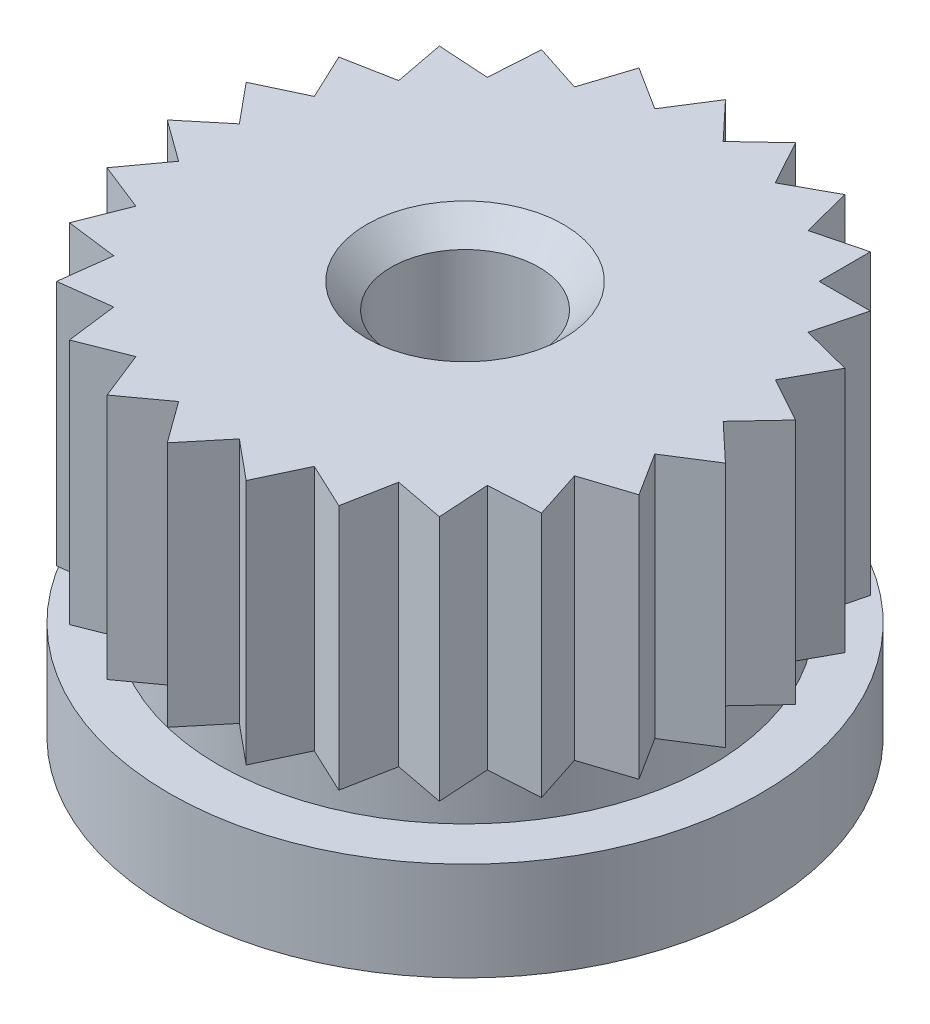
from build123d import *

# Parameters (mm, degrees)
SKETCH1_R                     = 3
BOSS_EXTRUDE1_DEPTH           = 4
SKETCH2_W                     = 0.65
SKETCH2_H                     = 0.65
CUT_EXTRUDE1_DEPTH            = 2.5
CIRPATTERN1_COUNT             = 25
SKETCH3_OUTSIDE_W             = 9.876
SKETCH3_OUTSIDE_H             = 9.876
SKETCH3_OUTSIDE_R             = 2.5
CUT_EXTRUDE2_DEPTH            = 0.5
CSK_FOR_M3_SFHCS1_D           = 1.5
CSK_FOR_M3_SFHCS1_CSINK_D     = 2
CSK_FOR_M3_SFHCS1_CSINK_ANGLE = 90


with BuildPart() as part:
    # Sketch1 → Boss-Extrude1 (new body)
    with BuildSketch(Plane(origin=(0, 0, 0), x_dir=(1, 0, 0), z_dir=(0, 1, 0))):
        with Locations(Location((0, 0, 0), (0, 0, 270))):
            Circle(SKETCH1_R)
    extrude(amount=BOSS_EXTRUDE1_DEPTH)

    # Sketch2 → Cut-Extrude1 (cut)
    with BuildSketch(Plane(origin=(0, 4, 0), x_dir=(1, 0, 0), z_dir=(0, 1, 0))):
        with Locations((2.121320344, 2.121320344)):
            Rectangle(SKETCH2_W, SKETCH2_H)
    cut_extrude1 = extrude(amount=-CUT_EXTRUDE1_DEPTH, mode=Mode.SUBTRACT)

    # CirPattern1: Cut-Extrude1 ×25 about axis
    cirpattern1_axis = Axis((0, 0, 0), (0, 1, 0))
    for i in range(1, CIRPATTERN1_COUNT):
        add(cut_extrude1.rotate(cirpattern1_axis, i * 360 / CIRPATTERN1_COUNT), mode=Mode.SUBTRACT)

    # Sketch3 outside → Cut-Extrude2 (cut)
    with BuildSketch(Plane(origin=(0, 1.5, 0), x_dir=(1, 0, 0), z_dir=(0, 1, 0))):
        Rectangle(SKETCH3_OUTSIDE_W, SKETCH3_OUTSIDE_H)
        with Locations(Location((0, 0, 0), (0, 0, 270))):
            Circle(SKETCH3_OUTSIDE_R, mode=Mode.SUBTRACT)
    extrude(amount=-CUT_EXTRUDE2_DEPTH, mode=Mode.SUBTRACT)

    # CSK for M3 SFHCS1 (through all)
    with Locations(Plane(origin=(0, 4, 0), x_dir=(1, 0, 0), z_dir=(0, 1, 0))):
        with Locations((0, 0)):
            CounterSinkHole(CSK_FOR_M3_SFHCS1_D / 2, CSK_FOR_M3_SFHCS1_CSINK_D / 2, counter_sink_angle=CSK_FOR_M3_SFHCS1_CSINK_ANGLE)


solid = part.part
